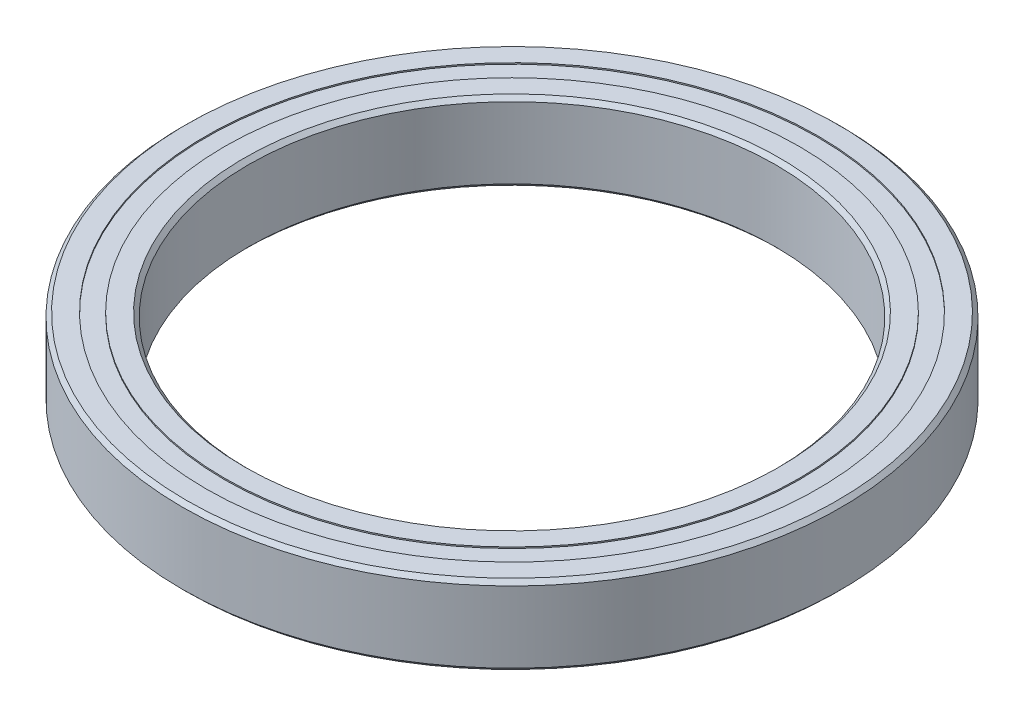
ISO-10303-21;
HEADER;
FILE_DESCRIPTION(('STEP AP214'),'2;1');
FILE_NAME('part.step','',(''),(''),'','','');
FILE_SCHEMA(('AUTOMOTIVE_DESIGN { 1 0 10303 214 1 1 1 1 }'));
ENDSEC;
DATA;
#1=APPLICATION_CONTEXT('core data for automotive mechanical design processes');
#2=APPLICATION_PROTOCOL_DEFINITION('international standard','automotive_design',2000,#1);
#3=PRODUCT_CONTEXT('',#1,'mechanical');
#4=PRODUCT('Part','Part','',(#3));
#5=PRODUCT_RELATED_PRODUCT_CATEGORY('part','',(#4));
#6=PRODUCT_DEFINITION_FORMATION('','',#4);
#7=PRODUCT_DEFINITION_CONTEXT('part definition',#1,'design');
#8=PRODUCT_DEFINITION('design','',#6,#7);
#9=PRODUCT_DEFINITION_SHAPE('','',#8);
#10=(LENGTH_UNIT() NAMED_UNIT(*) SI_UNIT(.MILLI.,.METRE.));
#11=(NAMED_UNIT(*) PLANE_ANGLE_UNIT() SI_UNIT($,.RADIAN.));
#12=(NAMED_UNIT(*) SI_UNIT($,.STERADIAN.) SOLID_ANGLE_UNIT());
#13=UNCERTAINTY_MEASURE_WITH_UNIT(LENGTH_MEASURE(1.E-05),#10,'distance_accuracy_value','');
#14=(GEOMETRIC_REPRESENTATION_CONTEXT(3) GLOBAL_UNCERTAINTY_ASSIGNED_CONTEXT((#13)) GLOBAL_UNIT_ASSIGNED_CONTEXT((#10,
#11,#12)) REPRESENTATION_CONTEXT('',''));
#15=CARTESIAN_POINT('',(0.,0.,0.));
#16=DIRECTION('',(0.,0.,1.));
#17=DIRECTION('',(1.,0.,0.));
#18=AXIS2_PLACEMENT_3D('',#15,#16,#17);
#19=CARTESIAN_POINT('',(0.,0.,0.));
#20=DIRECTION('',(0.,1.,0.));
#21=DIRECTION('',(0.,0.,1.));
#22=AXIS2_PLACEMENT_3D('',#19,#20,#21);
#23=PLANE('',#22);
#24=CARTESIAN_POINT('',(0.,0.,0.));
#25=DIRECTION('',(0.,1.,0.));
#26=DIRECTION('',(0.,0.,1.));
#27=AXIS2_PLACEMENT_3D('',#24,#25,#26);
#28=CIRCLE('',#27,20.3);
#29=CARTESIAN_POINT('',(0.,0.,20.3));
#30=VERTEX_POINT('',#29);
#31=EDGE_CURVE('E72',#30,#30,#28,.T.);
#32=ORIENTED_EDGE('',*,*,#31,.T.);
#33=EDGE_LOOP('',(#32));
#34=FACE_BOUND('',#33,.T.);
#35=CARTESIAN_POINT('',(0.,0.,0.));
#36=DIRECTION('',(0.,-1.,0.));
#37=DIRECTION('',(0.,0.,-1.));
#38=AXIS2_PLACEMENT_3D('',#35,#36,#37);
#39=CIRCLE('',#38,21.8);
#40=CARTESIAN_POINT('',(0.,0.,-21.8));
#41=VERTEX_POINT('',#40);
#42=EDGE_CURVE('E97',#41,#41,#39,.T.);
#43=ORIENTED_EDGE('',*,*,#42,.T.);
#44=EDGE_LOOP('',(#43));
#45=FACE_BOUND('',#44,.T.);
#46=ADVANCED_FACE('F45',(#34,#45),#23,.F.);
#47=CARTESIAN_POINT('',(0.,6.,0.));
#48=DIRECTION('',(0.,1.,0.));
#49=DIRECTION('',(0.,0.,1.));
#50=AXIS2_PLACEMENT_3D('',#47,#48,#49);
#51=PLANE('',#50);
#52=CARTESIAN_POINT('',(0.,6.,0.));
#53=DIRECTION('',(0.,1.,0.));
#54=DIRECTION('',(0.,0.,1.));
#55=AXIS2_PLACEMENT_3D('',#52,#53,#54);
#56=CIRCLE('',#55,20.3);
#57=CARTESIAN_POINT('',(0.,6.,20.3));
#58=VERTEX_POINT('',#57);
#59=EDGE_CURVE('E10',#58,#58,#56,.F.);
#60=ORIENTED_EDGE('',*,*,#59,.T.);
#61=EDGE_LOOP('',(#60));
#62=FACE_BOUND('',#61,.T.);
#63=CARTESIAN_POINT('',(0.,6.,0.));
#64=DIRECTION('',(0.,1.,0.));
#65=DIRECTION('',(0.,0.,1.));
#66=AXIS2_PLACEMENT_3D('',#63,#64,#65);
#67=CIRCLE('',#66,21.8);
#68=CARTESIAN_POINT('',(0.,6.,21.8));
#69=VERTEX_POINT('',#68);
#70=EDGE_CURVE('E85',#69,#69,#67,.T.);
#71=ORIENTED_EDGE('',*,*,#70,.T.);
#72=EDGE_LOOP('',(#71));
#73=FACE_BOUND('',#72,.T.);
#74=ADVANCED_FACE('F154',(#62,#73),#51,.T.);
#75=CARTESIAN_POINT('',(0.,6.,0.));
#76=DIRECTION('',(0.,1.,0.));
#77=DIRECTION('',(0.,0.,1.));
#78=AXIS2_PLACEMENT_3D('',#75,#76,#77);
#79=CIRCLE('',#78,23.2);
#80=CARTESIAN_POINT('',(0.,6.,23.2));
#81=VERTEX_POINT('',#80);
#82=EDGE_CURVE('E79',#81,#81,#79,.T.);
#83=ORIENTED_EDGE('',*,*,#82,.F.);
#84=EDGE_LOOP('',(#83));
#85=FACE_BOUND('',#84,.T.);
#86=CARTESIAN_POINT('',(0.,6.,0.));
#87=DIRECTION('',(0.,1.,0.));
#88=DIRECTION('',(0.,0.,1.));
#89=AXIS2_PLACEMENT_3D('',#86,#87,#88);
#90=CIRCLE('',#89,24.7);
#91=CARTESIAN_POINT('',(0.,6.,24.7));
#92=VERTEX_POINT('',#91);
#93=EDGE_CURVE('E53',#92,#92,#90,.T.);
#94=ORIENTED_EDGE('',*,*,#93,.T.);
#95=EDGE_LOOP('',(#94));
#96=FACE_BOUND('',#95,.T.);
#97=ADVANCED_FACE('F123',(#85,#96),#51,.T.);
#98=CARTESIAN_POINT('',(0.,0.,0.));
#99=DIRECTION('',(0.,-1.,0.));
#100=DIRECTION('',(0.,0.,-1.));
#101=AXIS2_PLACEMENT_3D('',#98,#99,#100);
#102=CIRCLE('',#101,23.2);
#103=CARTESIAN_POINT('',(0.,0.,-23.2));
#104=VERTEX_POINT('',#103);
#105=EDGE_CURVE('E91',#104,#104,#102,.T.);
#106=ORIENTED_EDGE('',*,*,#105,.F.);
#107=EDGE_LOOP('',(#106));
#108=FACE_BOUND('',#107,.T.);
#109=CARTESIAN_POINT('',(0.,0.,0.));
#110=DIRECTION('',(0.,1.,0.));
#111=DIRECTION('',(0.,0.,1.));
#112=AXIS2_PLACEMENT_3D('',#109,#110,#111);
#113=CIRCLE('',#112,24.7);
#114=CARTESIAN_POINT('',(0.,0.,24.7));
#115=VERTEX_POINT('',#114);
#116=EDGE_CURVE('E75',#115,#115,#113,.F.);
#117=ORIENTED_EDGE('',*,*,#116,.T.);
#118=EDGE_LOOP('',(#117));
#119=FACE_BOUND('',#118,.T.);
#120=ADVANCED_FACE('F119',(#108,#119),#23,.F.);
#121=CARTESIAN_POINT('',(0.,6.,0.));
#122=DIRECTION('',(0.,-1.,0.));
#123=DIRECTION('',(0.,0.,-1.));
#124=AXIS2_PLACEMENT_3D('',#121,#122,#123);
#125=CYLINDRICAL_SURFACE('',#124,25.);
#126=CARTESIAN_POINT('',(0.,0.300000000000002,0.));
#127=DIRECTION('',(0.,1.,0.));
#128=DIRECTION('',(0.,0.,1.));
#129=AXIS2_PLACEMENT_3D('',#126,#127,#128);
#130=CIRCLE('',#129,25.);
#131=CARTESIAN_POINT('',(0.,0.300000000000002,25.));
#132=VERTEX_POINT('',#131);
#133=EDGE_CURVE('E57',#132,#132,#130,.T.);
#134=ORIENTED_EDGE('',*,*,#133,.T.);
#135=EDGE_LOOP('',(#134));
#136=FACE_BOUND('',#135,.T.);
#137=CARTESIAN_POINT('',(0.,5.69999999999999,0.));
#138=DIRECTION('',(0.,1.,0.));
#139=DIRECTION('',(0.,0.,1.));
#140=AXIS2_PLACEMENT_3D('',#137,#138,#139);
#141=CIRCLE('',#140,25.);
#142=CARTESIAN_POINT('',(0.,5.69999999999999,25.));
#143=VERTEX_POINT('',#142);
#144=EDGE_CURVE('E61',#143,#143,#141,.F.);
#145=ORIENTED_EDGE('',*,*,#144,.T.);
#146=EDGE_LOOP('',(#145));
#147=FACE_BOUND('',#146,.T.);
#148=ADVANCED_FACE('F122',(#136,#147),#125,.T.);
#149=CARTESIAN_POINT('',(0.,6.,0.));
#150=DIRECTION('',(0.,-1.,0.));
#151=DIRECTION('',(0.,0.,-1.));
#152=AXIS2_PLACEMENT_3D('',#149,#150,#151);
#153=CYLINDRICAL_SURFACE('',#152,20.);
#154=CARTESIAN_POINT('',(0.,0.300000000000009,0.));
#155=DIRECTION('',(0.,1.,0.));
#156=DIRECTION('',(0.,0.,1.));
#157=AXIS2_PLACEMENT_3D('',#154,#155,#156);
#158=CIRCLE('',#157,20.);
#159=CARTESIAN_POINT('',(0.,0.300000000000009,20.));
#160=VERTEX_POINT('',#159);
#161=EDGE_CURVE('E66',#160,#160,#158,.F.);
#162=ORIENTED_EDGE('',*,*,#161,.T.);
#163=EDGE_LOOP('',(#162));
#164=FACE_BOUND('',#163,.T.);
#165=CARTESIAN_POINT('',(0.,5.70000000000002,0.));
#166=DIRECTION('',(0.,1.,0.));
#167=DIRECTION('',(0.,0.,1.));
#168=AXIS2_PLACEMENT_3D('',#165,#166,#167);
#169=CIRCLE('',#168,20.);
#170=CARTESIAN_POINT('',(0.,5.70000000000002,20.));
#171=VERTEX_POINT('',#170);
#172=EDGE_CURVE('E69',#171,#171,#169,.T.);
#173=ORIENTED_EDGE('',*,*,#172,.T.);
#174=EDGE_LOOP('',(#173));
#175=FACE_BOUND('',#174,.T.);
#176=ADVANCED_FACE('F137',(#164,#175),#153,.F.);
#177=CARTESIAN_POINT('',(0.,0.,0.));
#178=DIRECTION('',(0.,-1.,0.));
#179=DIRECTION('',(0.,0.,-1.));
#180=AXIS2_PLACEMENT_3D('',#177,#178,#179);
#181=CONICAL_SURFACE('',#180,20.3,0.785398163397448);
#182=ORIENTED_EDGE('',*,*,#161,.F.);
#183=EDGE_LOOP('',(#182));
#184=FACE_BOUND('',#183,.T.);
#185=ORIENTED_EDGE('',*,*,#31,.F.);
#186=EDGE_LOOP('',(#185));
#187=FACE_BOUND('',#186,.T.);
#188=ADVANCED_FACE('F131',(#184,#187),#181,.F.);
#189=CARTESIAN_POINT('',(0.,0.300000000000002,0.));
#190=DIRECTION('',(0.,1.,0.));
#191=DIRECTION('',(0.,0.,1.));
#192=AXIS2_PLACEMENT_3D('',#189,#190,#191);
#193=CONICAL_SURFACE('',#192,25.,0.785398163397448);
#194=ORIENTED_EDGE('',*,*,#116,.F.);
#195=EDGE_LOOP('',(#194));
#196=FACE_BOUND('',#195,.T.);
#197=ORIENTED_EDGE('',*,*,#133,.F.);
#198=EDGE_LOOP('',(#197));
#199=FACE_BOUND('',#198,.T.);
#200=ADVANCED_FACE('F127',(#196,#199),#193,.T.);
#201=CARTESIAN_POINT('',(0.,5.70000000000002,0.));
#202=DIRECTION('',(0.,1.,0.));
#203=DIRECTION('',(0.,0.,1.));
#204=AXIS2_PLACEMENT_3D('',#201,#202,#203);
#205=CONICAL_SURFACE('',#204,20.,0.785398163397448);
#206=ORIENTED_EDGE('',*,*,#59,.F.);
#207=EDGE_LOOP('',(#206));
#208=FACE_BOUND('',#207,.T.);
#209=ORIENTED_EDGE('',*,*,#172,.F.);
#210=EDGE_LOOP('',(#209));
#211=FACE_BOUND('',#210,.T.);
#212=ADVANCED_FACE('F130',(#208,#211),#205,.F.);
#213=CARTESIAN_POINT('',(0.,6.,0.));
#214=DIRECTION('',(0.,-1.,0.));
#215=DIRECTION('',(0.,0.,-1.));
#216=AXIS2_PLACEMENT_3D('',#213,#214,#215);
#217=CONICAL_SURFACE('',#216,24.7,0.785398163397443);
#218=ORIENTED_EDGE('',*,*,#144,.F.);
#219=EDGE_LOOP('',(#218));
#220=FACE_BOUND('',#219,.T.);
#221=ORIENTED_EDGE('',*,*,#93,.F.);
#222=EDGE_LOOP('',(#221));
#223=FACE_BOUND('',#222,.T.);
#224=ADVANCED_FACE('F48',(#220,#223),#217,.T.);
#225=CARTESIAN_POINT('',(0.,5.9,0.));
#226=DIRECTION('',(0.,1.,0.));
#227=DIRECTION('',(0.,0.,1.));
#228=AXIS2_PLACEMENT_3D('',#225,#226,#227);
#229=CYLINDRICAL_SURFACE('',#228,23.2);
#230=CARTESIAN_POINT('',(0.,5.9,0.));
#231=DIRECTION('',(0.,1.,0.));
#232=DIRECTION('',(0.,0.,1.));
#233=AXIS2_PLACEMENT_3D('',#230,#231,#232);
#234=CIRCLE('',#233,23.2);
#235=CARTESIAN_POINT('',(0.,5.9,23.2));
#236=VERTEX_POINT('',#235);
#237=EDGE_CURVE('E78',#236,#236,#234,.T.);
#238=ORIENTED_EDGE('',*,*,#237,.F.);
#239=EDGE_LOOP('',(#238));
#240=FACE_BOUND('',#239,.T.);
#241=ORIENTED_EDGE('',*,*,#82,.T.);
#242=EDGE_LOOP('',(#241));
#243=FACE_BOUND('',#242,.T.);
#244=ADVANCED_FACE('F143',(#240,#243),#229,.F.);
#245=CARTESIAN_POINT('',(0.,5.9,0.));
#246=DIRECTION('',(0.,1.,0.));
#247=DIRECTION('',(0.,0.,1.));
#248=AXIS2_PLACEMENT_3D('',#245,#246,#247);
#249=PLANE('',#248);
#250=CARTESIAN_POINT('',(0.,5.9,0.));
#251=DIRECTION('',(0.,1.,0.));
#252=DIRECTION('',(0.,0.,1.));
#253=AXIS2_PLACEMENT_3D('',#250,#251,#252);
#254=CIRCLE('',#253,21.8);
#255=CARTESIAN_POINT('',(0.,5.9,21.8));
#256=VERTEX_POINT('',#255);
#257=EDGE_CURVE('E82',#256,#256,#254,.T.);
#258=ORIENTED_EDGE('',*,*,#257,.F.);
#259=EDGE_LOOP('',(#258));
#260=FACE_BOUND('',#259,.T.);
#261=ORIENTED_EDGE('',*,*,#237,.T.);
#262=EDGE_LOOP('',(#261));
#263=FACE_BOUND('',#262,.T.);
#264=ADVANCED_FACE('F149',(#260,#263),#249,.T.);
#265=CARTESIAN_POINT('',(0.,5.9,0.));
#266=DIRECTION('',(0.,1.,0.));
#267=DIRECTION('',(0.,0.,1.));
#268=AXIS2_PLACEMENT_3D('',#265,#266,#267);
#269=CYLINDRICAL_SURFACE('',#268,21.8);
#270=ORIENTED_EDGE('',*,*,#257,.T.);
#271=EDGE_LOOP('',(#270));
#272=FACE_BOUND('',#271,.T.);
#273=ORIENTED_EDGE('',*,*,#70,.F.);
#274=EDGE_LOOP('',(#273));
#275=FACE_BOUND('',#274,.T.);
#276=ADVANCED_FACE('F115',(#272,#275),#269,.T.);
#277=CARTESIAN_POINT('',(0.,0.1,0.));
#278=DIRECTION('',(0.,-1.,0.));
#279=DIRECTION('',(0.,0.,-1.));
#280=AXIS2_PLACEMENT_3D('',#277,#278,#279);
#281=CYLINDRICAL_SURFACE('',#280,23.2);
#282=CARTESIAN_POINT('',(0.,0.1,0.));
#283=DIRECTION('',(0.,-1.,0.));
#284=DIRECTION('',(0.,0.,-1.));
#285=AXIS2_PLACEMENT_3D('',#282,#283,#284);
#286=CIRCLE('',#285,23.2);
#287=CARTESIAN_POINT('',(0.,0.1,-23.2));
#288=VERTEX_POINT('',#287);
#289=EDGE_CURVE('E88',#288,#288,#286,.T.);
#290=ORIENTED_EDGE('',*,*,#289,.F.);
#291=EDGE_LOOP('',(#290));
#292=FACE_BOUND('',#291,.T.);
#293=ORIENTED_EDGE('',*,*,#105,.T.);
#294=EDGE_LOOP('',(#293));
#295=FACE_BOUND('',#294,.T.);
#296=ADVANCED_FACE('F109',(#292,#295),#281,.F.);
#297=CARTESIAN_POINT('',(0.,0.1,0.));
#298=DIRECTION('',(0.,-1.,0.));
#299=DIRECTION('',(0.,0.,-1.));
#300=AXIS2_PLACEMENT_3D('',#297,#298,#299);
#301=PLANE('',#300);
#302=CARTESIAN_POINT('',(0.,0.1,0.));
#303=DIRECTION('',(0.,-1.,0.));
#304=DIRECTION('',(0.,0.,-1.));
#305=AXIS2_PLACEMENT_3D('',#302,#303,#304);
#306=CIRCLE('',#305,21.8);
#307=CARTESIAN_POINT('',(0.,0.1,-21.8));
#308=VERTEX_POINT('',#307);
#309=EDGE_CURVE('E94',#308,#308,#306,.T.);
#310=ORIENTED_EDGE('',*,*,#309,.F.);
#311=EDGE_LOOP('',(#310));
#312=FACE_BOUND('',#311,.T.);
#313=ORIENTED_EDGE('',*,*,#289,.T.);
#314=EDGE_LOOP('',(#313));
#315=FACE_BOUND('',#314,.T.);
#316=ADVANCED_FACE('F106',(#312,#315),#301,.T.);
#317=CARTESIAN_POINT('',(0.,0.1,0.));
#318=DIRECTION('',(0.,-1.,0.));
#319=DIRECTION('',(0.,0.,-1.));
#320=AXIS2_PLACEMENT_3D('',#317,#318,#319);
#321=CYLINDRICAL_SURFACE('',#320,21.8);
#322=ORIENTED_EDGE('',*,*,#309,.T.);
#323=EDGE_LOOP('',(#322));
#324=FACE_BOUND('',#323,.T.);
#325=ORIENTED_EDGE('',*,*,#42,.F.);
#326=EDGE_LOOP('',(#325));
#327=FACE_BOUND('',#326,.T.);
#328=ADVANCED_FACE('F103',(#324,#327),#321,.T.);
#329=CLOSED_SHELL('',(#46,#74,#97,#120,#148,#176,#188,#200,#212,#224,#244,#264,#276,#296,#316,#328));
#330=MANIFOLD_SOLID_BREP('B2',#329);
#331=ADVANCED_BREP_SHAPE_REPRESENTATION('',(#18,#330),#14);
#332=SHAPE_DEFINITION_REPRESENTATION(#9,#331);
ENDSEC;
END-ISO-10303-21;
